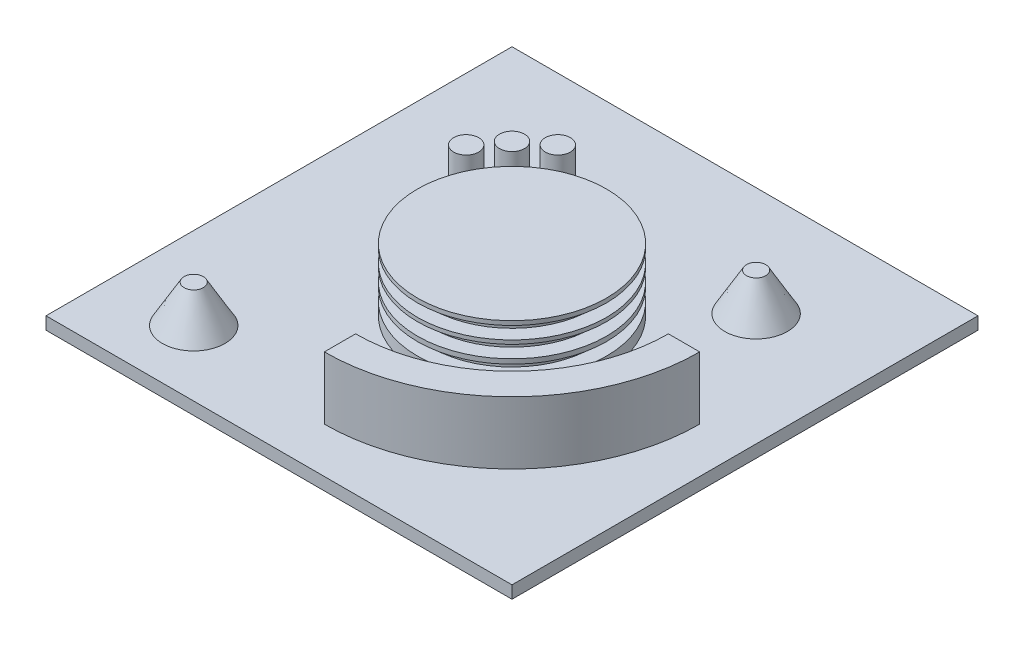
ISO-10303-21;
HEADER;
FILE_DESCRIPTION(('STEP AP214'),'2;1');
FILE_NAME('part.step','',(''),(''),'','','');
FILE_SCHEMA(('AUTOMOTIVE_DESIGN { 1 0 10303 214 1 1 1 1 }'));
ENDSEC;
DATA;
#1=APPLICATION_CONTEXT('core data for automotive mechanical design processes');
#2=APPLICATION_PROTOCOL_DEFINITION('international standard','automotive_design',2000,#1);
#3=PRODUCT_CONTEXT('',#1,'mechanical');
#4=PRODUCT('Part','Part','',(#3));
#5=PRODUCT_RELATED_PRODUCT_CATEGORY('part','',(#4));
#6=PRODUCT_DEFINITION_FORMATION('','',#4);
#7=PRODUCT_DEFINITION_CONTEXT('part definition',#1,'design');
#8=PRODUCT_DEFINITION('design','',#6,#7);
#9=PRODUCT_DEFINITION_SHAPE('','',#8);
#10=(LENGTH_UNIT() NAMED_UNIT(*) SI_UNIT(.MILLI.,.METRE.));
#11=(NAMED_UNIT(*) PLANE_ANGLE_UNIT() SI_UNIT($,.RADIAN.));
#12=(NAMED_UNIT(*) SI_UNIT($,.STERADIAN.) SOLID_ANGLE_UNIT());
#13=UNCERTAINTY_MEASURE_WITH_UNIT(LENGTH_MEASURE(1.E-05),#10,'distance_accuracy_value','');
#14=(GEOMETRIC_REPRESENTATION_CONTEXT(3) GLOBAL_UNCERTAINTY_ASSIGNED_CONTEXT((#13)) GLOBAL_UNIT_ASSIGNED_CONTEXT((#10,
#11,#12)) REPRESENTATION_CONTEXT('',''));
#15=CARTESIAN_POINT('',(0.,0.,0.));
#16=DIRECTION('',(0.,0.,1.));
#17=DIRECTION('',(1.,0.,0.));
#18=AXIS2_PLACEMENT_3D('',#15,#16,#17);
#19=CARTESIAN_POINT('',(0.,15.24,0.));
#20=DIRECTION('',(0.,-1.,0.));
#21=DIRECTION('',(0.,0.,-1.));
#22=AXIS2_PLACEMENT_3D('',#19,#20,#21);
#23=CYLINDRICAL_SURFACE('',#22,19.1850048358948);
#24=CARTESIAN_POINT('',(0.,8.54029885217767,0.));
#25=DIRECTION('',(0.,1.,0.));
#26=DIRECTION('',(0.,0.,1.));
#27=AXIS2_PLACEMENT_3D('',#24,#25,#26);
#28=CIRCLE('',#27,19.1850048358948);
#29=CARTESIAN_POINT('',(0.,8.54029885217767,19.1850048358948));
#30=VERTEX_POINT('',#29);
#31=EDGE_CURVE('E180',#30,#30,#28,.T.);
#32=ORIENTED_EDGE('',*,*,#31,.F.);
#33=EDGE_LOOP('',(#32));
#34=FACE_BOUND('',#33,.T.);
#35=CARTESIAN_POINT('',(0.,7.58720550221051,0.));
#36=DIRECTION('',(0.,-1.,0.));
#37=DIRECTION('',(0.,0.,-1.));
#38=AXIS2_PLACEMENT_3D('',#35,#36,#37);
#39=CIRCLE('',#38,19.1850048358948);
#40=CARTESIAN_POINT('',(0.,7.58720550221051,-19.1850048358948));
#41=VERTEX_POINT('',#40);
#42=EDGE_CURVE('E184',#41,#41,#39,.T.);
#43=ORIENTED_EDGE('',*,*,#42,.F.);
#44=EDGE_LOOP('',(#43));
#45=FACE_BOUND('',#44,.T.);
#46=ADVANCED_FACE('F32',(#34,#45),#23,.T.);
#47=CARTESIAN_POINT('',(0.,11.8521905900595,0.));
#48=DIRECTION('',(0.,1.,0.));
#49=DIRECTION('',(0.,0.,1.));
#50=AXIS2_PLACEMENT_3D('',#47,#48,#49);
#51=CIRCLE('',#50,19.1850048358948);
#52=CARTESIAN_POINT('',(0.,11.8521905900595,19.1850048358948));
#53=VERTEX_POINT('',#52);
#54=EDGE_CURVE('E172',#53,#53,#51,.T.);
#55=ORIENTED_EDGE('',*,*,#54,.F.);
#56=EDGE_LOOP('',(#55));
#57=FACE_BOUND('',#56,.T.);
#58=CARTESIAN_POINT('',(0.,11.0802988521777,0.));
#59=DIRECTION('',(0.,-1.,0.));
#60=DIRECTION('',(0.,0.,-1.));
#61=AXIS2_PLACEMENT_3D('',#58,#59,#60);
#62=CIRCLE('',#61,19.1850048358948);
#63=CARTESIAN_POINT('',(0.,11.0802988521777,-19.1850048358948));
#64=VERTEX_POINT('',#63);
#65=EDGE_CURVE('E177',#64,#64,#62,.T.);
#66=ORIENTED_EDGE('',*,*,#65,.F.);
#67=EDGE_LOOP('',(#66));
#68=FACE_BOUND('',#67,.T.);
#69=ADVANCED_FACE('F248',(#57,#68),#23,.T.);
#70=CARTESIAN_POINT('',(0.,11.8521905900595,-16.2967884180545));
#71=DIRECTION('',(0.,1.,0.));
#72=DIRECTION('',(0.,0.,1.));
#73=AXIS2_PLACEMENT_3D('',#70,#71,#72);
#74=PLANE('',#73);
#75=CARTESIAN_POINT('',(0.,11.8521905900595,0.));
#76=DIRECTION('',(0.,1.,0.));
#77=DIRECTION('',(0.,0.,1.));
#78=AXIS2_PLACEMENT_3D('',#75,#76,#77);
#79=CIRCLE('',#78,16.2967884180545);
#80=CARTESIAN_POINT('',(0.,11.8521905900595,16.2967884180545));
#81=VERTEX_POINT('',#80);
#82=EDGE_CURVE('E173',#81,#81,#79,.T.);
#83=ORIENTED_EDGE('',*,*,#82,.F.);
#84=EDGE_LOOP('',(#83));
#85=FACE_BOUND('',#84,.T.);
#86=ORIENTED_EDGE('',*,*,#54,.T.);
#87=EDGE_LOOP('',(#86));
#88=FACE_BOUND('',#87,.T.);
#89=ADVANCED_FACE('F255',(#85,#88),#74,.T.);
#90=CARTESIAN_POINT('',(0.,14.3921905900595,-16.2967884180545));
#91=DIRECTION('',(0.,-1.,0.));
#92=DIRECTION('',(0.,0.,-1.));
#93=AXIS2_PLACEMENT_3D('',#90,#91,#92);
#94=PLANE('',#93);
#95=CARTESIAN_POINT('',(0.,14.3921905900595,0.));
#96=DIRECTION('',(0.,1.,0.));
#97=DIRECTION('',(0.,0.,1.));
#98=AXIS2_PLACEMENT_3D('',#95,#96,#97);
#99=CIRCLE('',#98,16.2967884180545);
#100=CARTESIAN_POINT('',(0.,14.3921905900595,16.2967884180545));
#101=VERTEX_POINT('',#100);
#102=EDGE_CURVE('E183',#101,#101,#99,.T.);
#103=ORIENTED_EDGE('',*,*,#102,.T.);
#104=EDGE_LOOP('',(#103));
#105=FACE_BOUND('',#104,.T.);
#106=CARTESIAN_POINT('',(0.,14.3921905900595,0.));
#107=DIRECTION('',(0.,-1.,0.));
#108=DIRECTION('',(0.,0.,-1.));
#109=AXIS2_PLACEMENT_3D('',#106,#107,#108);
#110=CIRCLE('',#109,19.1850048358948);
#111=CARTESIAN_POINT('',(0.,14.3921905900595,-19.1850048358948));
#112=VERTEX_POINT('',#111);
#113=EDGE_CURVE('E169',#112,#112,#110,.T.);
#114=ORIENTED_EDGE('',*,*,#113,.T.);
#115=EDGE_LOOP('',(#114));
#116=FACE_BOUND('',#115,.T.);
#117=ADVANCED_FACE('F289',(#105,#116),#94,.T.);
#118=CARTESIAN_POINT('',(0.,15.24,0.));
#119=DIRECTION('',(0.,1.,0.));
#120=DIRECTION('',(0.,0.,1.));
#121=AXIS2_PLACEMENT_3D('',#118,#119,#120);
#122=CYLINDRICAL_SURFACE('',#121,16.2967884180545);
#123=ORIENTED_EDGE('',*,*,#82,.T.);
#124=EDGE_LOOP('',(#123));
#125=FACE_BOUND('',#124,.T.);
#126=ORIENTED_EDGE('',*,*,#102,.F.);
#127=EDGE_LOOP('',(#126));
#128=FACE_BOUND('',#127,.T.);
#129=ADVANCED_FACE('F283',(#125,#128),#122,.T.);
#130=CARTESIAN_POINT('',(0.,15.24,0.));
#131=DIRECTION('',(0.,1.,0.));
#132=DIRECTION('',(0.,0.,1.));
#133=AXIS2_PLACEMENT_3D('',#130,#131,#132);
#134=PLANE('',#133);
#135=CARTESIAN_POINT('',(0.,15.24,0.));
#136=DIRECTION('',(0.,1.,0.));
#137=DIRECTION('',(0.,0.,1.));
#138=AXIS2_PLACEMENT_3D('',#135,#136,#137);
#139=CIRCLE('',#138,19.1850048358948);
#140=CARTESIAN_POINT('',(0.,15.24,19.1850048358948));
#141=VERTEX_POINT('',#140);
#142=EDGE_CURVE('E221',#141,#141,#139,.T.);
#143=ORIENTED_EDGE('',*,*,#142,.T.);
#144=EDGE_LOOP('',(#143));
#145=FACE_BOUND('',#144,.T.);
#146=ADVANCED_FACE('F274',(#145),#134,.T.);
#147=ORIENTED_EDGE('',*,*,#142,.F.);
#148=EDGE_LOOP('',(#147));
#149=FACE_BOUND('',#148,.T.);
#150=ORIENTED_EDGE('',*,*,#113,.F.);
#151=EDGE_LOOP('',(#150));
#152=FACE_BOUND('',#151,.T.);
#153=ADVANCED_FACE('F257',(#149,#152),#23,.T.);
#154=CARTESIAN_POINT('',(0.,8.54029885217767,-16.2967884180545));
#155=DIRECTION('',(0.,1.,0.));
#156=DIRECTION('',(0.,0.,1.));
#157=AXIS2_PLACEMENT_3D('',#154,#155,#156);
#158=PLANE('',#157);
#159=CARTESIAN_POINT('',(0.,8.54029885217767,0.));
#160=DIRECTION('',(0.,1.,0.));
#161=DIRECTION('',(0.,0.,1.));
#162=AXIS2_PLACEMENT_3D('',#159,#160,#161);
#163=CIRCLE('',#162,16.2967884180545);
#164=CARTESIAN_POINT('',(0.,8.54029885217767,16.2967884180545));
#165=VERTEX_POINT('',#164);
#166=EDGE_CURVE('E181',#165,#165,#163,.T.);
#167=ORIENTED_EDGE('',*,*,#166,.F.);
#168=EDGE_LOOP('',(#167));
#169=FACE_BOUND('',#168,.T.);
#170=ORIENTED_EDGE('',*,*,#31,.T.);
#171=EDGE_LOOP('',(#170));
#172=FACE_BOUND('',#171,.T.);
#173=ADVANCED_FACE('F273',(#169,#172),#158,.T.);
#174=CARTESIAN_POINT('',(0.,11.0802988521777,-16.2967884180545));
#175=DIRECTION('',(0.,-1.,0.));
#176=DIRECTION('',(0.,0.,-1.));
#177=AXIS2_PLACEMENT_3D('',#174,#175,#176);
#178=PLANE('',#177);
#179=CARTESIAN_POINT('',(0.,11.0802988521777,0.));
#180=DIRECTION('',(0.,1.,0.));
#181=DIRECTION('',(0.,0.,1.));
#182=AXIS2_PLACEMENT_3D('',#179,#180,#181);
#183=CIRCLE('',#182,16.2967884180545);
#184=CARTESIAN_POINT('',(0.,11.0802988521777,16.2967884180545));
#185=VERTEX_POINT('',#184);
#186=EDGE_CURVE('E190',#185,#185,#183,.T.);
#187=ORIENTED_EDGE('',*,*,#186,.T.);
#188=EDGE_LOOP('',(#187));
#189=FACE_BOUND('',#188,.T.);
#190=ORIENTED_EDGE('',*,*,#65,.T.);
#191=EDGE_LOOP('',(#190));
#192=FACE_BOUND('',#191,.T.);
#193=ADVANCED_FACE('F280',(#189,#192),#178,.T.);
#194=CARTESIAN_POINT('',(0.,15.24,0.));
#195=DIRECTION('',(0.,1.,0.));
#196=DIRECTION('',(0.,0.,1.));
#197=AXIS2_PLACEMENT_3D('',#194,#195,#196);
#198=CYLINDRICAL_SURFACE('',#197,16.2967884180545);
#199=ORIENTED_EDGE('',*,*,#166,.T.);
#200=EDGE_LOOP('',(#199));
#201=FACE_BOUND('',#200,.T.);
#202=ORIENTED_EDGE('',*,*,#186,.F.);
#203=EDGE_LOOP('',(#202));
#204=FACE_BOUND('',#203,.T.);
#205=ADVANCED_FACE('F302',(#201,#204),#198,.T.);
#206=CARTESIAN_POINT('',(0.,5.04720550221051,-16.2967884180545));
#207=DIRECTION('',(0.,1.,0.));
#208=DIRECTION('',(0.,0.,1.));
#209=AXIS2_PLACEMENT_3D('',#206,#207,#208);
#210=PLANE('',#209);
#211=CARTESIAN_POINT('',(0.,5.04720550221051,0.));
#212=DIRECTION('',(0.,1.,0.));
#213=DIRECTION('',(0.,0.,1.));
#214=AXIS2_PLACEMENT_3D('',#211,#212,#213);
#215=CIRCLE('',#214,16.2967884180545);
#216=CARTESIAN_POINT('',(0.,5.04720550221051,16.2967884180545));
#217=VERTEX_POINT('',#216);
#218=EDGE_CURVE('E186',#217,#217,#215,.T.);
#219=ORIENTED_EDGE('',*,*,#218,.F.);
#220=EDGE_LOOP('',(#219));
#221=FACE_BOUND('',#220,.T.);
#222=CARTESIAN_POINT('',(0.,5.04720550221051,0.));
#223=DIRECTION('',(0.,1.,0.));
#224=DIRECTION('',(0.,0.,1.));
#225=AXIS2_PLACEMENT_3D('',#222,#223,#224);
#226=CIRCLE('',#225,19.1850048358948);
#227=CARTESIAN_POINT('',(0.,5.04720550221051,19.1850048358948));
#228=VERTEX_POINT('',#227);
#229=EDGE_CURVE('E36',#228,#228,#226,.T.);
#230=ORIENTED_EDGE('',*,*,#229,.T.);
#231=EDGE_LOOP('',(#230));
#232=FACE_BOUND('',#231,.T.);
#233=ADVANCED_FACE('F430',(#221,#232),#210,.T.);
#234=CARTESIAN_POINT('',(0.,7.58720550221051,-16.2967884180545));
#235=DIRECTION('',(0.,-1.,0.));
#236=DIRECTION('',(0.,0.,-1.));
#237=AXIS2_PLACEMENT_3D('',#234,#235,#236);
#238=PLANE('',#237);
#239=CARTESIAN_POINT('',(0.,7.58720550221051,0.));
#240=DIRECTION('',(0.,1.,0.));
#241=DIRECTION('',(0.,0.,1.));
#242=AXIS2_PLACEMENT_3D('',#239,#240,#241);
#243=CIRCLE('',#242,16.2967884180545);
#244=CARTESIAN_POINT('',(0.,7.58720550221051,16.2967884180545));
#245=VERTEX_POINT('',#244);
#246=EDGE_CURVE('E192',#245,#245,#243,.T.);
#247=ORIENTED_EDGE('',*,*,#246,.T.);
#248=EDGE_LOOP('',(#247));
#249=FACE_BOUND('',#248,.T.);
#250=ORIENTED_EDGE('',*,*,#42,.T.);
#251=EDGE_LOOP('',(#250));
#252=FACE_BOUND('',#251,.T.);
#253=ADVANCED_FACE('F439',(#249,#252),#238,.T.);
#254=CARTESIAN_POINT('',(0.,15.24,0.));
#255=DIRECTION('',(0.,1.,0.));
#256=DIRECTION('',(0.,0.,1.));
#257=AXIS2_PLACEMENT_3D('',#254,#255,#256);
#258=CYLINDRICAL_SURFACE('',#257,16.2967884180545);
#259=ORIENTED_EDGE('',*,*,#218,.T.);
#260=EDGE_LOOP('',(#259));
#261=FACE_BOUND('',#260,.T.);
#262=ORIENTED_EDGE('',*,*,#246,.F.);
#263=EDGE_LOOP('',(#262));
#264=FACE_BOUND('',#263,.T.);
#265=ADVANCED_FACE('F308',(#261,#264),#258,.T.);
#266=CARTESIAN_POINT('',(-30.6027669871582,10.16,34.0079217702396));
#267=DIRECTION('',(0.,1.,0.));
#268=DIRECTION('',(0.,0.,1.));
#269=AXIS2_PLACEMENT_3D('',#266,#267,#268);
#270=PLANE('',#269);
#271=CARTESIAN_POINT('',(-30.6027669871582,10.16,34.0079217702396));
#272=DIRECTION('',(0.,1.,0.));
#273=DIRECTION('',(0.,0.,1.));
#274=AXIS2_PLACEMENT_3D('',#271,#272,#273);
#275=CIRCLE('',#274,1.95059094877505);
#276=CARTESIAN_POINT('',(-30.6027669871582,10.16,35.9585127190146));
#277=VERTEX_POINT('',#276);
#278=EDGE_CURVE('E176',#277,#277,#275,.T.);
#279=ORIENTED_EDGE('',*,*,#278,.T.);
#280=EDGE_LOOP('',(#279));
#281=FACE_BOUND('',#280,.T.);
#282=ADVANCED_FACE('F304',(#281),#270,.T.);
#283=CARTESIAN_POINT('',(-21.9970452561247,15.24,-12.7));
#284=DIRECTION('',(0.,1.,0.));
#285=DIRECTION('',(0.,0.,1.));
#286=AXIS2_PLACEMENT_3D('',#283,#284,#285);
#287=PLANE('',#286);
#288=CARTESIAN_POINT('',(-21.9970452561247,15.24,-12.7));
#289=DIRECTION('',(0.,1.,0.));
#290=DIRECTION('',(0.,0.,1.));
#291=AXIS2_PLACEMENT_3D('',#288,#289,#290);
#292=CIRCLE('',#291,2.54);
#293=CARTESIAN_POINT('',(-21.9970452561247,15.24,-10.16));
#294=VERTEX_POINT('',#293);
#295=EDGE_CURVE('E212',#294,#294,#292,.T.);
#296=ORIENTED_EDGE('',*,*,#295,.T.);
#297=EDGE_LOOP('',(#296));
#298=FACE_BOUND('',#297,.T.);
#299=ADVANCED_FACE('F307',(#298),#287,.T.);
#300=CARTESIAN_POINT('',(-12.6999999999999,15.24,-21.9970452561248));
#301=DIRECTION('',(0.,1.,0.));
#302=DIRECTION('',(0.,0.,1.));
#303=AXIS2_PLACEMENT_3D('',#300,#301,#302);
#304=PLANE('',#303);
#305=CARTESIAN_POINT('',(-12.6999999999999,15.24,-21.9970452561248));
#306=DIRECTION('',(0.,1.,0.));
#307=DIRECTION('',(0.,0.,1.));
#308=AXIS2_PLACEMENT_3D('',#305,#306,#307);
#309=CIRCLE('',#308,2.54);
#310=CARTESIAN_POINT('',(-12.6999999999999,15.24,-19.4570452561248));
#311=VERTEX_POINT('',#310);
#312=EDGE_CURVE('E218',#311,#311,#309,.T.);
#313=ORIENTED_EDGE('',*,*,#312,.T.);
#314=EDGE_LOOP('',(#313));
#315=FACE_BOUND('',#314,.T.);
#316=ADVANCED_FACE('F326',(#315),#304,.T.);
#317=CARTESIAN_POINT('',(0.,15.24,0.));
#318=DIRECTION('',(0.,1.,0.));
#319=DIRECTION('',(0.,0.,1.));
#320=AXIS2_PLACEMENT_3D('',#317,#318,#319);
#321=PLANE('',#320);
#322=CARTESIAN_POINT('',(0.,15.24,0.));
#323=DIRECTION('',(0.,1.,0.));
#324=DIRECTION('',(0.,0.,1.));
#325=AXIS2_PLACEMENT_3D('',#322,#323,#324);
#326=CIRCLE('',#325,38.1);
#327=CARTESIAN_POINT('',(0.,15.24,38.1));
#328=VERTEX_POINT('',#327);
#329=CARTESIAN_POINT('',(38.1,15.24,0.));
#330=VERTEX_POINT('',#329);
#331=EDGE_CURVE('E107',#328,#330,#326,.T.);
#332=ORIENTED_EDGE('',*,*,#331,.T.);
#333=DIRECTION('',(-1.,0.,0.));
#334=VECTOR('',#333,1.);
#335=CARTESIAN_POINT('',(31.75,15.24,0.));
#336=LINE('',#335,#334);
#337=CARTESIAN_POINT('',(31.75,15.24,0.));
#338=VERTEX_POINT('',#337);
#339=EDGE_CURVE('E96',#330,#338,#336,.T.);
#340=ORIENTED_EDGE('',*,*,#339,.T.);
#341=CARTESIAN_POINT('',(0.,15.24,0.));
#342=DIRECTION('',(0.,-1.,0.));
#343=DIRECTION('',(0.,0.,-1.));
#344=AXIS2_PLACEMENT_3D('',#341,#342,#343);
#345=CIRCLE('',#344,31.75);
#346=CARTESIAN_POINT('',(0.,15.24,31.75));
#347=VERTEX_POINT('',#346);
#348=EDGE_CURVE('E106',#338,#347,#345,.T.);
#349=ORIENTED_EDGE('',*,*,#348,.T.);
#350=DIRECTION('',(0.,0.,1.));
#351=VECTOR('',#350,1.);
#352=CARTESIAN_POINT('',(0.,15.24,31.75));
#353=LINE('',#352,#351);
#354=EDGE_CURVE('E112',#347,#328,#353,.T.);
#355=ORIENTED_EDGE('',*,*,#354,.T.);
#356=EDGE_LOOP('',(#332,#340,#349,#355));
#357=FACE_BOUND('',#356,.T.);
#358=ADVANCED_FACE('F110',(#357),#321,.T.);
#359=CARTESIAN_POINT('',(-47.2962725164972,0.,-47.2962725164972));
#360=DIRECTION('',(0.,-1.,0.));
#361=DIRECTION('',(0.,0.,-1.));
#362=AXIS2_PLACEMENT_3D('',#359,#360,#361);
#363=PLANE('',#362);
#364=DIRECTION('',(0.,0.,1.));
#365=VECTOR('',#364,1.);
#366=CARTESIAN_POINT('',(-47.2962725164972,0.,47.2962725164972));
#367=LINE('',#366,#365);
#368=CARTESIAN_POINT('',(-47.2962725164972,0.,-47.2962725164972));
#369=VERTEX_POINT('',#368);
#370=CARTESIAN_POINT('',(-47.2962725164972,0.,47.2962725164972));
#371=VERTEX_POINT('',#370);
#372=EDGE_CURVE('E120',#369,#371,#367,.T.);
#373=ORIENTED_EDGE('',*,*,#372,.F.);
#374=DIRECTION('',(-1.,0.,0.));
#375=VECTOR('',#374,1.);
#376=CARTESIAN_POINT('',(-47.2962725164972,0.,-47.2962725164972));
#377=LINE('',#376,#375);
#378=CARTESIAN_POINT('',(47.2962725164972,0.,-47.2962725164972));
#379=VERTEX_POINT('',#378);
#380=EDGE_CURVE('E132',#379,#369,#377,.T.);
#381=ORIENTED_EDGE('',*,*,#380,.F.);
#382=DIRECTION('',(0.,0.,-1.));
#383=VECTOR('',#382,1.);
#384=CARTESIAN_POINT('',(47.2962725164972,0.,47.2962725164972));
#385=LINE('',#384,#383);
#386=CARTESIAN_POINT('',(47.2962725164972,0.,47.2962725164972));
#387=VERTEX_POINT('',#386);
#388=EDGE_CURVE('E130',#387,#379,#385,.T.);
#389=ORIENTED_EDGE('',*,*,#388,.F.);
#390=DIRECTION('',(1.,0.,0.));
#391=VECTOR('',#390,1.);
#392=CARTESIAN_POINT('',(-47.2962725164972,0.,47.2962725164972));
#393=LINE('',#392,#391);
#394=EDGE_CURVE('E123',#371,#387,#393,.T.);
#395=ORIENTED_EDGE('',*,*,#394,.F.);
#396=EDGE_LOOP('',(#373,#381,#389,#395));
#397=FACE_BOUND('',#396,.T.);
#398=ADVANCED_FACE('F333',(#397),#363,.T.);
#399=CARTESIAN_POINT('',(-17.9605122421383,15.24,-17.9605122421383));
#400=DIRECTION('',(0.,1.,0.));
#401=DIRECTION('',(0.,0.,1.));
#402=AXIS2_PLACEMENT_3D('',#399,#400,#401);
#403=PLANE('',#402);
#404=CARTESIAN_POINT('',(-17.9605122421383,15.24,-17.9605122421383));
#405=DIRECTION('',(0.,1.,0.));
#406=DIRECTION('',(0.,0.,1.));
#407=AXIS2_PLACEMENT_3D('',#404,#405,#406);
#408=CIRCLE('',#407,2.54);
#409=CARTESIAN_POINT('',(-17.9605122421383,15.24,-15.4205122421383));
#410=VERTEX_POINT('',#409);
#411=EDGE_CURVE('E215',#410,#410,#408,.T.);
#412=ORIENTED_EDGE('',*,*,#411,.T.);
#413=EDGE_LOOP('',(#412));
#414=FACE_BOUND('',#413,.T.);
#415=ADVANCED_FACE('F318',(#414),#403,.T.);
#416=CARTESIAN_POINT('',(24.3768164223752,10.16,-25.1816606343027));
#417=DIRECTION('',(0.,1.,0.));
#418=DIRECTION('',(0.,0.,1.));
#419=AXIS2_PLACEMENT_3D('',#416,#417,#418);
#420=PLANE('',#419);
#421=CARTESIAN_POINT('',(24.3768164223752,10.16,-25.1816606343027));
#422=DIRECTION('',(0.,1.,0.));
#423=DIRECTION('',(0.,0.,1.));
#424=AXIS2_PLACEMENT_3D('',#421,#422,#423);
#425=CIRCLE('',#424,1.95059094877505);
#426=CARTESIAN_POINT('',(24.3768164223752,10.16,-23.2310696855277));
#427=VERTEX_POINT('',#426);
#428=EDGE_CURVE('E209',#427,#427,#425,.T.);
#429=ORIENTED_EDGE('',*,*,#428,.T.);
#430=EDGE_LOOP('',(#429));
#431=FACE_BOUND('',#430,.T.);
#432=ADVANCED_FACE('F314',(#431),#420,.T.);
#433=CARTESIAN_POINT('',(-30.6027669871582,2.54,34.0079217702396));
#434=DIRECTION('',(0.,-1.,0.));
#435=DIRECTION('',(0.,0.,1.));
#436=AXIS2_PLACEMENT_3D('',#433,#434,#435);
#437=CONICAL_SURFACE('',#436,6.35,0.523598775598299);
#438=CARTESIAN_POINT('',(-30.6027669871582,2.54,34.0079217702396));
#439=DIRECTION('',(0.,-1.,0.));
#440=DIRECTION('',(0.,0.,-1.));
#441=AXIS2_PLACEMENT_3D('',#438,#439,#440);
#442=CIRCLE('',#441,6.35);
#443=CARTESIAN_POINT('',(-30.6027669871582,2.54,40.3579217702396));
#444=VERTEX_POINT('',#443);
#445=EDGE_CURVE('E11',#444,#444,#442,.F.);
#446=CARTESIAN_POINT('',(-30.6027669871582,10.16,35.9585127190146));
#447=CARTESIAN_POINT('',(-30.6027669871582,10.080625,36.0043398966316));
#448=CARTESIAN_POINT('',(-30.6027669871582,10.00125,36.0501670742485));
#449=CARTESIAN_POINT('',(-30.6027669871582,9.8425,36.1418214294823));
#450=CARTESIAN_POINT('',(-30.6027669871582,9.763125,36.1876486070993));
#451=CARTESIAN_POINT('',(-30.6027669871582,9.604375,36.2793029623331));
#452=CARTESIAN_POINT('',(-30.6027669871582,9.525,36.3251301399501));
#453=CARTESIAN_POINT('',(-30.6027669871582,9.36625,36.4167844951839));
#454=CARTESIAN_POINT('',(-30.6027669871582,9.286875,36.4626116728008));
#455=CARTESIAN_POINT('',(-30.6027669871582,9.128125,36.5542660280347));
#456=CARTESIAN_POINT('',(-30.6027669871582,9.04875,36.6000932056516));
#457=CARTESIAN_POINT('',(-30.6027669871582,8.89,36.6917475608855));
#458=CARTESIAN_POINT('',(-30.6027669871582,8.810625,36.7375747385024));
#459=CARTESIAN_POINT('',(-30.6027669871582,8.651875,36.8292290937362));
#460=CARTESIAN_POINT('',(-30.6027669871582,8.5725,36.8750562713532));
#461=CARTESIAN_POINT('',(-30.6027669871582,8.41375,36.966710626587));
#462=CARTESIAN_POINT('',(-30.6027669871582,8.334375,37.012537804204));
#463=CARTESIAN_POINT('',(-30.6027669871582,8.175625,37.1041921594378));
#464=CARTESIAN_POINT('',(-30.6027669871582,8.09625,37.1500193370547));
#465=CARTESIAN_POINT('',(-30.6027669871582,7.9375,37.2416736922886));
#466=CARTESIAN_POINT('',(-30.6027669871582,7.858125,37.2875008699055));
#467=CARTESIAN_POINT('',(-30.6027669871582,7.699375,37.3791552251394));
#468=CARTESIAN_POINT('',(-30.6027669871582,7.62,37.4249824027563));
#469=CARTESIAN_POINT('',(-30.6027669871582,7.46125,37.5166367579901));
#470=CARTESIAN_POINT('',(-30.6027669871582,7.381875,37.5624639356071));
#471=CARTESIAN_POINT('',(-30.6027669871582,7.223125,37.6541182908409));
#472=CARTESIAN_POINT('',(-30.6027669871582,7.14375,37.6999454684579));
#473=CARTESIAN_POINT('',(-30.6027669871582,6.985,37.7915998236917));
#474=CARTESIAN_POINT('',(-30.6027669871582,6.905625,37.8374270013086));
#475=CARTESIAN_POINT('',(-30.6027669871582,6.746875,37.9290813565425));
#476=CARTESIAN_POINT('',(-30.6027669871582,6.6675,37.9749085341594));
#477=CARTESIAN_POINT('',(-30.6027669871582,6.50875,38.0665628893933));
#478=CARTESIAN_POINT('',(-30.6027669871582,6.429375,38.1123900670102));
#479=CARTESIAN_POINT('',(-30.6027669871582,6.270625,38.204044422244));
#480=CARTESIAN_POINT('',(-30.6027669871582,6.19125,38.249871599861));
#481=CARTESIAN_POINT('',(-30.6027669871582,6.0325,38.3415259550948));
#482=CARTESIAN_POINT('',(-30.6027669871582,5.953125,38.3873531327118));
#483=CARTESIAN_POINT('',(-30.6027669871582,5.794375,38.4790074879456));
#484=CARTESIAN_POINT('',(-30.6027669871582,5.715,38.5248346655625));
#485=CARTESIAN_POINT('',(-30.6027669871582,5.55625,38.6164890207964));
#486=CARTESIAN_POINT('',(-30.6027669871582,5.476875,38.6623161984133));
#487=CARTESIAN_POINT('',(-30.6027669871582,5.318125,38.7539705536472));
#488=CARTESIAN_POINT('',(-30.6027669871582,5.23875,38.7997977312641));
#489=CARTESIAN_POINT('',(-30.6027669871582,5.08,38.8914520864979));
#490=CARTESIAN_POINT('',(-30.6027669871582,5.000625,38.9372792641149));
#491=CARTESIAN_POINT('',(-30.6027669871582,4.841875,39.0289336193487));
#492=CARTESIAN_POINT('',(-30.6027669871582,4.7625,39.0747607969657));
#493=CARTESIAN_POINT('',(-30.6027669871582,4.60375,39.1664151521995));
#494=CARTESIAN_POINT('',(-30.6027669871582,4.524375,39.2122423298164));
#495=CARTESIAN_POINT('',(-30.6027669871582,4.365625,39.3038966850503));
#496=CARTESIAN_POINT('',(-30.6027669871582,4.28625,39.3497238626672));
#497=CARTESIAN_POINT('',(-30.6027669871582,4.1275,39.4413782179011));
#498=CARTESIAN_POINT('',(-30.6027669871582,4.048125,39.487205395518));
#499=CARTESIAN_POINT('',(-30.6027669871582,3.889375,39.5788597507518));
#500=CARTESIAN_POINT('',(-30.6027669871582,3.81,39.6246869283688));
#501=CARTESIAN_POINT('',(-30.6027669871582,3.65125,39.7163412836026));
#502=CARTESIAN_POINT('',(-30.6027669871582,3.571875,39.7621684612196));
#503=CARTESIAN_POINT('',(-30.6027669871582,3.413125,39.8538228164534));
#504=CARTESIAN_POINT('',(-30.6027669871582,3.33375,39.8996499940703));
#505=CARTESIAN_POINT('',(-30.6027669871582,3.175,39.9913043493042));
#506=CARTESIAN_POINT('',(-30.6027669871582,3.095625,40.0371315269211));
#507=CARTESIAN_POINT('',(-30.6027669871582,2.936875,40.128785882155));
#508=CARTESIAN_POINT('',(-30.6027669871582,2.8575,40.1746130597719));
#509=CARTESIAN_POINT('',(-30.6027669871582,2.69875,40.2662674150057));
#510=CARTESIAN_POINT('',(-30.6027669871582,2.619375,40.3120945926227));
#511=CARTESIAN_POINT('',(-30.6027669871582,2.54,40.3579217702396));
#512=B_SPLINE_CURVE_WITH_KNOTS('',3,(#446,#447,#448,#449,#450,#451,#452,#453,#454,#455,#456,
#457,#458,#459,#460,#461,#462,#463,#464,#465,#466,#467,#468,#469,#470,#471,#472,#473,#474,#475,
#476,#477,#478,#479,#480,#481,#482,#483,#484,#485,#486,#487,#488,#489,#490,#491,#492,#493,#494,
#495,#496,#497,#498,#499,#500,#501,#502,#503,#504,#505,#506,#507,#508,#509,#510,#511),
.UNSPECIFIED.,.F.,.F.,(4,2,2,2,2,2,2,2,2,2,2,2,2,2,2,2,2,2,2,2,2,2,2,2,2,2,2,2,2,2,2,2,4),(0.,
0.274963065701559,0.549926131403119,0.824889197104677,1.09985226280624,1.3748153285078,
1.64977839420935,1.92474145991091,2.19970452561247,2.47466759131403,2.74963065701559,
3.02459372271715,3.29955678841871,3.57451985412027,3.84948291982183,4.12444598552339,
4.39940905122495,4.67437211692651,4.94933518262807,5.22429824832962,5.49926131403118,
5.77422437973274,6.0491874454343,6.32415051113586,6.59911357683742,6.87407664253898,
7.14903970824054,7.4240027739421,7.69896583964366,7.97392890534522,8.24889197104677,
8.52385503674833,8.79881810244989),.UNSPECIFIED.);
#513=EDGE_CURVE('BSEAM310',#277,#444,#512,.T.);
#514=ORIENTED_EDGE('',*,*,#278,.F.);
#515=ORIENTED_EDGE('',*,*,#445,.T.);
#516=ORIENTED_EDGE('',*,*,#513,.T.);
#517=ORIENTED_EDGE('',*,*,#513,.F.);
#518=EDGE_LOOP('',(#514,#516,#515,#517));
#519=FACE_BOUND('',#518,.T.);
#520=ADVANCED_FACE('F310',(#519),#437,.T.);
#521=CARTESIAN_POINT('',(-21.9970452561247,15.24,-12.7));
#522=DIRECTION('',(0.,-1.,0.));
#523=DIRECTION('',(0.,0.,-1.));
#524=AXIS2_PLACEMENT_3D('',#521,#522,#523);
#525=CYLINDRICAL_SURFACE('',#524,2.54);
#526=ORIENTED_EDGE('',*,*,#295,.F.);
#527=EDGE_LOOP('',(#526));
#528=FACE_BOUND('',#527,.T.);
#529=CARTESIAN_POINT('',(-21.9970452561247,2.54,-12.7));
#530=DIRECTION('',(0.,-1.,0.));
#531=DIRECTION('',(0.,0.,-1.));
#532=AXIS2_PLACEMENT_3D('',#529,#530,#531);
#533=CIRCLE('',#532,2.54);
#534=CARTESIAN_POINT('',(-21.9970452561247,2.54,-15.24));
#535=VERTEX_POINT('',#534);
#536=EDGE_CURVE('E164',#535,#535,#533,.F.);
#537=ORIENTED_EDGE('',*,*,#536,.T.);
#538=EDGE_LOOP('',(#537));
#539=FACE_BOUND('',#538,.T.);
#540=ADVANCED_FACE('F313',(#528,#539),#525,.T.);
#541=CARTESIAN_POINT('',(-12.6999999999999,15.24,-21.9970452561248));
#542=DIRECTION('',(0.,-1.,0.));
#543=DIRECTION('',(0.,0.,-1.));
#544=AXIS2_PLACEMENT_3D('',#541,#542,#543);
#545=CYLINDRICAL_SURFACE('',#544,2.54);
#546=ORIENTED_EDGE('',*,*,#312,.F.);
#547=EDGE_LOOP('',(#546));
#548=FACE_BOUND('',#547,.T.);
#549=CARTESIAN_POINT('',(-12.6999999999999,2.54,-21.9970452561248));
#550=DIRECTION('',(0.,-1.,0.));
#551=DIRECTION('',(0.,0.,-1.));
#552=AXIS2_PLACEMENT_3D('',#549,#550,#551);
#553=CIRCLE('',#552,2.54);
#554=CARTESIAN_POINT('',(-12.6999999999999,2.54,-24.5370452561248));
#555=VERTEX_POINT('',#554);
#556=EDGE_CURVE('E158',#555,#555,#553,.F.);
#557=ORIENTED_EDGE('',*,*,#556,.T.);
#558=EDGE_LOOP('',(#557));
#559=FACE_BOUND('',#558,.T.);
#560=ADVANCED_FACE('F245',(#548,#559),#545,.T.);
#561=CARTESIAN_POINT('',(31.75,15.24,0.));
#562=DIRECTION('',(0.,0.,1.));
#563=DIRECTION('',(1.,0.,0.));
#564=AXIS2_PLACEMENT_3D('',#561,#562,#563);
#565=PLANE('',#564);
#566=DIRECTION('',(-1.,0.,0.));
#567=VECTOR('',#566,1.);
#568=CARTESIAN_POINT('',(31.75,2.54,0.));
#569=LINE('',#568,#567);
#570=CARTESIAN_POINT('',(38.1,2.54,0.));
#571=VERTEX_POINT('',#570);
#572=CARTESIAN_POINT('',(31.75,2.54,0.));
#573=VERTEX_POINT('',#572);
#574=EDGE_CURVE('E49',#571,#573,#569,.T.);
#575=ORIENTED_EDGE('',*,*,#574,.T.);
#576=DIRECTION('',(0.,-1.,0.));
#577=VECTOR('',#576,1.);
#578=CARTESIAN_POINT('',(31.75,15.24,0.));
#579=LINE('',#578,#577);
#580=EDGE_CURVE('E103',#338,#573,#579,.T.);
#581=ORIENTED_EDGE('',*,*,#580,.F.);
#582=ORIENTED_EDGE('',*,*,#339,.F.);
#583=DIRECTION('',(0.,-1.,0.));
#584=VECTOR('',#583,1.);
#585=CARTESIAN_POINT('',(38.1,15.24,0.));
#586=LINE('',#585,#584);
#587=EDGE_CURVE('E100',#330,#571,#586,.T.);
#588=ORIENTED_EDGE('',*,*,#587,.T.);
#589=EDGE_LOOP('',(#575,#581,#582,#588));
#590=FACE_BOUND('',#589,.T.);
#591=ADVANCED_FACE('F98',(#590),#565,.F.);
#592=CARTESIAN_POINT('',(0.,15.24,0.));
#593=DIRECTION('',(0.,-1.,0.));
#594=DIRECTION('',(0.,0.,-1.));
#595=AXIS2_PLACEMENT_3D('',#592,#593,#594);
#596=CYLINDRICAL_SURFACE('',#595,31.75);
#597=CARTESIAN_POINT('',(0.,2.54,0.));
#598=DIRECTION('',(0.,-1.,0.));
#599=DIRECTION('',(0.,0.,-1.));
#600=AXIS2_PLACEMENT_3D('',#597,#598,#599);
#601=CIRCLE('',#600,31.75);
#602=CARTESIAN_POINT('',(0.,2.54,31.75));
#603=VERTEX_POINT('',#602);
#604=EDGE_CURVE('E54',#573,#603,#601,.T.);
#605=ORIENTED_EDGE('',*,*,#604,.T.);
#606=DIRECTION('',(0.,-1.,0.));
#607=VECTOR('',#606,1.);
#608=CARTESIAN_POINT('',(0.,15.24,31.75));
#609=LINE('',#608,#607);
#610=EDGE_CURVE('E125',#347,#603,#609,.T.);
#611=ORIENTED_EDGE('',*,*,#610,.F.);
#612=ORIENTED_EDGE('',*,*,#348,.F.);
#613=ORIENTED_EDGE('',*,*,#580,.T.);
#614=EDGE_LOOP('',(#605,#611,#612,#613));
#615=FACE_BOUND('',#614,.T.);
#616=ADVANCED_FACE('F237',(#615),#596,.F.);
#617=CARTESIAN_POINT('',(0.,15.24,31.75));
#618=DIRECTION('',(1.,0.,0.));
#619=DIRECTION('',(0.,0.,-1.));
#620=AXIS2_PLACEMENT_3D('',#617,#618,#619);
#621=PLANE('',#620);
#622=DIRECTION('',(0.,0.,1.));
#623=VECTOR('',#622,1.);
#624=CARTESIAN_POINT('',(0.,2.54,31.75));
#625=LINE('',#624,#623);
#626=CARTESIAN_POINT('',(0.,2.54,38.1));
#627=VERTEX_POINT('',#626);
#628=EDGE_CURVE('E116',#603,#627,#625,.T.);
#629=ORIENTED_EDGE('',*,*,#628,.T.);
#630=DIRECTION('',(0.,-1.,0.));
#631=VECTOR('',#630,1.);
#632=CARTESIAN_POINT('',(0.,15.24,38.1));
#633=LINE('',#632,#631);
#634=EDGE_CURVE('E226',#328,#627,#633,.T.);
#635=ORIENTED_EDGE('',*,*,#634,.F.);
#636=ORIENTED_EDGE('',*,*,#354,.F.);
#637=ORIENTED_EDGE('',*,*,#610,.T.);
#638=EDGE_LOOP('',(#629,#635,#636,#637));
#639=FACE_BOUND('',#638,.T.);
#640=ADVANCED_FACE('F235',(#639),#621,.F.);
#641=CARTESIAN_POINT('',(0.,15.24,0.));
#642=DIRECTION('',(0.,-1.,0.));
#643=DIRECTION('',(0.,0.,-1.));
#644=AXIS2_PLACEMENT_3D('',#641,#642,#643);
#645=CYLINDRICAL_SURFACE('',#644,38.1);
#646=CARTESIAN_POINT('',(0.,2.54,0.));
#647=DIRECTION('',(0.,1.,0.));
#648=DIRECTION('',(0.,0.,1.));
#649=AXIS2_PLACEMENT_3D('',#646,#647,#648);
#650=CIRCLE('',#649,38.1);
#651=EDGE_CURVE('E119',#627,#571,#650,.T.);
#652=ORIENTED_EDGE('',*,*,#651,.T.);
#653=ORIENTED_EDGE('',*,*,#587,.F.);
#654=ORIENTED_EDGE('',*,*,#331,.F.);
#655=ORIENTED_EDGE('',*,*,#634,.T.);
#656=EDGE_LOOP('',(#652,#653,#654,#655));
#657=FACE_BOUND('',#656,.T.);
#658=ADVANCED_FACE('F118',(#657),#645,.T.);
#659=CARTESIAN_POINT('',(-47.2962725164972,2.54,-47.2962725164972));
#660=DIRECTION('',(0.,0.,1.));
#661=DIRECTION('',(1.,0.,0.));
#662=AXIS2_PLACEMENT_3D('',#659,#660,#661);
#663=PLANE('',#662);
#664=ORIENTED_EDGE('',*,*,#380,.T.);
#665=DIRECTION('',(0.,-1.,0.));
#666=VECTOR('',#665,1.);
#667=CARTESIAN_POINT('',(-47.2962725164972,2.54,-47.2962725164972));
#668=LINE('',#667,#666);
#669=CARTESIAN_POINT('',(-47.2962725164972,2.54,-47.2962725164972));
#670=VERTEX_POINT('',#669);
#671=EDGE_CURVE('E143',#670,#369,#668,.T.);
#672=ORIENTED_EDGE('',*,*,#671,.F.);
#673=DIRECTION('',(-1.,0.,0.));
#674=VECTOR('',#673,1.);
#675=CARTESIAN_POINT('',(-47.2962725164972,2.54,-47.2962725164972));
#676=LINE('',#675,#674);
#677=CARTESIAN_POINT('',(47.2962725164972,2.54,-47.2962725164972));
#678=VERTEX_POINT('',#677);
#679=EDGE_CURVE('E141',#678,#670,#676,.T.);
#680=ORIENTED_EDGE('',*,*,#679,.F.);
#681=DIRECTION('',(0.,-1.,0.));
#682=VECTOR('',#681,1.);
#683=CARTESIAN_POINT('',(47.2962725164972,2.54,-47.2962725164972));
#684=LINE('',#683,#682);
#685=EDGE_CURVE('E146',#678,#379,#684,.T.);
#686=ORIENTED_EDGE('',*,*,#685,.T.);
#687=EDGE_LOOP('',(#664,#672,#680,#686));
#688=FACE_BOUND('',#687,.T.);
#689=ADVANCED_FACE('F557',(#688),#663,.F.);
#690=CARTESIAN_POINT('',(47.2962725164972,2.54,47.2962725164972));
#691=DIRECTION('',(-1.,0.,0.));
#692=DIRECTION('',(0.,0.,1.));
#693=AXIS2_PLACEMENT_3D('',#690,#691,#692);
#694=PLANE('',#693);
#695=ORIENTED_EDGE('',*,*,#388,.T.);
#696=ORIENTED_EDGE('',*,*,#685,.F.);
#697=DIRECTION('',(0.,0.,-1.));
#698=VECTOR('',#697,1.);
#699=CARTESIAN_POINT('',(47.2962725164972,2.54,47.2962725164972));
#700=LINE('',#699,#698);
#701=CARTESIAN_POINT('',(47.2962725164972,2.54,47.2962725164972));
#702=VERTEX_POINT('',#701);
#703=EDGE_CURVE('E139',#702,#678,#700,.T.);
#704=ORIENTED_EDGE('',*,*,#703,.F.);
#705=DIRECTION('',(0.,-1.,0.));
#706=VECTOR('',#705,1.);
#707=CARTESIAN_POINT('',(47.2962725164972,2.54,47.2962725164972));
#708=LINE('',#707,#706);
#709=EDGE_CURVE('E149',#702,#387,#708,.T.);
#710=ORIENTED_EDGE('',*,*,#709,.T.);
#711=EDGE_LOOP('',(#695,#696,#704,#710));
#712=FACE_BOUND('',#711,.T.);
#713=ADVANCED_FACE('F550',(#712),#694,.F.);
#714=CARTESIAN_POINT('',(-47.2962725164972,2.54,47.2962725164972));
#715=DIRECTION('',(0.,0.,-1.));
#716=DIRECTION('',(-1.,0.,0.));
#717=AXIS2_PLACEMENT_3D('',#714,#715,#716);
#718=PLANE('',#717);
#719=ORIENTED_EDGE('',*,*,#394,.T.);
#720=ORIENTED_EDGE('',*,*,#709,.F.);
#721=DIRECTION('',(1.,0.,0.));
#722=VECTOR('',#721,1.);
#723=CARTESIAN_POINT('',(-47.2962725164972,2.54,47.2962725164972));
#724=LINE('',#723,#722);
#725=CARTESIAN_POINT('',(-47.2962725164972,2.54,47.2962725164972));
#726=VERTEX_POINT('',#725);
#727=EDGE_CURVE('E137',#726,#702,#724,.T.);
#728=ORIENTED_EDGE('',*,*,#727,.F.);
#729=DIRECTION('',(0.,-1.,0.));
#730=VECTOR('',#729,1.);
#731=CARTESIAN_POINT('',(-47.2962725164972,2.54,47.2962725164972));
#732=LINE('',#731,#730);
#733=EDGE_CURVE('E152',#726,#371,#732,.T.);
#734=ORIENTED_EDGE('',*,*,#733,.T.);
#735=EDGE_LOOP('',(#719,#720,#728,#734));
#736=FACE_BOUND('',#735,.T.);
#737=ADVANCED_FACE('F543',(#736),#718,.F.);
#738=CARTESIAN_POINT('',(-47.2962725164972,2.54,47.2962725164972));
#739=DIRECTION('',(1.,0.,0.));
#740=DIRECTION('',(0.,0.,-1.));
#741=AXIS2_PLACEMENT_3D('',#738,#739,#740);
#742=PLANE('',#741);
#743=ORIENTED_EDGE('',*,*,#372,.T.);
#744=ORIENTED_EDGE('',*,*,#733,.F.);
#745=DIRECTION('',(0.,0.,1.));
#746=VECTOR('',#745,1.);
#747=CARTESIAN_POINT('',(-47.2962725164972,2.54,47.2962725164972));
#748=LINE('',#747,#746);
#749=EDGE_CURVE('E134',#670,#726,#748,.T.);
#750=ORIENTED_EDGE('',*,*,#749,.F.);
#751=ORIENTED_EDGE('',*,*,#671,.T.);
#752=EDGE_LOOP('',(#743,#744,#750,#751));
#753=FACE_BOUND('',#752,.T.);
#754=ADVANCED_FACE('F34',(#753),#742,.F.);
#755=CARTESIAN_POINT('',(-17.9605122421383,15.24,-17.9605122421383));
#756=DIRECTION('',(0.,-1.,0.));
#757=DIRECTION('',(0.,0.,-1.));
#758=AXIS2_PLACEMENT_3D('',#755,#756,#757);
#759=CYLINDRICAL_SURFACE('',#758,2.54);
#760=ORIENTED_EDGE('',*,*,#411,.F.);
#761=EDGE_LOOP('',(#760));
#762=FACE_BOUND('',#761,.T.);
#763=CARTESIAN_POINT('',(-17.9605122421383,2.54,-17.9605122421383));
#764=DIRECTION('',(0.,-1.,0.));
#765=DIRECTION('',(0.,0.,-1.));
#766=AXIS2_PLACEMENT_3D('',#763,#764,#765);
#767=CIRCLE('',#766,2.54);
#768=CARTESIAN_POINT('',(-17.9605122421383,2.54,-20.5005122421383));
#769=VERTEX_POINT('',#768);
#770=EDGE_CURVE('E161',#769,#769,#767,.F.);
#771=ORIENTED_EDGE('',*,*,#770,.T.);
#772=EDGE_LOOP('',(#771));
#773=FACE_BOUND('',#772,.T.);
#774=ADVANCED_FACE('F322',(#762,#773),#759,.T.);
#775=CARTESIAN_POINT('',(24.3768164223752,2.54,-25.1816606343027));
#776=DIRECTION('',(0.,-1.,0.));
#777=DIRECTION('',(0.,0.,1.));
#778=AXIS2_PLACEMENT_3D('',#775,#776,#777);
#779=CONICAL_SURFACE('',#778,6.35,0.523598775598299);
#780=CARTESIAN_POINT('',(24.3768164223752,2.54,-25.1816606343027));
#781=DIRECTION('',(0.,-1.,0.));
#782=DIRECTION('',(0.,0.,-1.));
#783=AXIS2_PLACEMENT_3D('',#780,#781,#782);
#784=CIRCLE('',#783,6.35);
#785=CARTESIAN_POINT('',(24.3768164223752,2.54,-18.8316606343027));
#786=VERTEX_POINT('',#785);
#787=EDGE_CURVE('E41',#786,#786,#784,.F.);
#788=CARTESIAN_POINT('',(24.3768164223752,10.16,-23.2310696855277));
#789=CARTESIAN_POINT('',(24.3768164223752,10.080625,-23.1852425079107));
#790=CARTESIAN_POINT('',(24.3768164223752,10.00125,-23.1394153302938));
#791=CARTESIAN_POINT('',(24.3768164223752,9.8425,-23.04776097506));
#792=CARTESIAN_POINT('',(24.3768164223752,9.763125,-23.001933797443));
#793=CARTESIAN_POINT('',(24.3768164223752,9.604375,-22.9102794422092));
#794=CARTESIAN_POINT('',(24.3768164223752,9.525,-22.8644522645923));
#795=CARTESIAN_POINT('',(24.3768164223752,9.36625,-22.7727979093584));
#796=CARTESIAN_POINT('',(24.3768164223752,9.286875,-22.7269707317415));
#797=CARTESIAN_POINT('',(24.3768164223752,9.128125,-22.6353163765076));
#798=CARTESIAN_POINT('',(24.3768164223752,9.04875,-22.5894891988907));
#799=CARTESIAN_POINT('',(24.3768164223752,8.89,-22.4978348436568));
#800=CARTESIAN_POINT('',(24.3768164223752,8.810625,-22.4520076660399));
#801=CARTESIAN_POINT('',(24.3768164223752,8.651875,-22.3603533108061));
#802=CARTESIAN_POINT('',(24.3768164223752,8.5725,-22.3145261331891));
#803=CARTESIAN_POINT('',(24.3768164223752,8.41375,-22.2228717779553));
#804=CARTESIAN_POINT('',(24.3768164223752,8.334375,-22.1770446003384));
#805=CARTESIAN_POINT('',(24.3768164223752,8.175625,-22.0853902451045));
#806=CARTESIAN_POINT('',(24.3768164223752,8.09625,-22.0395630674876));
#807=CARTESIAN_POINT('',(24.3768164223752,7.9375,-21.9479087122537));
#808=CARTESIAN_POINT('',(24.3768164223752,7.858125,-21.9020815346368));
#809=CARTESIAN_POINT('',(24.3768164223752,7.699375,-21.8104271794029));
#810=CARTESIAN_POINT('',(24.3768164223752,7.62,-21.764600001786));
#811=CARTESIAN_POINT('',(24.3768164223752,7.46125,-21.6729456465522));
#812=CARTESIAN_POINT('',(24.3768164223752,7.381875,-21.6271184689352));
#813=CARTESIAN_POINT('',(24.3768164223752,7.223125,-21.5354641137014));
#814=CARTESIAN_POINT('',(24.3768164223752,7.14375,-21.4896369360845));
#815=CARTESIAN_POINT('',(24.3768164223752,6.985,-21.3979825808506));
#816=CARTESIAN_POINT('',(24.3768164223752,6.905625,-21.3521554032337));
#817=CARTESIAN_POINT('',(24.3768164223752,6.746875,-21.2605010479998));
#818=CARTESIAN_POINT('',(24.3768164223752,6.6675,-21.2146738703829));
#819=CARTESIAN_POINT('',(24.3768164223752,6.50875,-21.123019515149));
#820=CARTESIAN_POINT('',(24.3768164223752,6.429375,-21.0771923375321));
#821=CARTESIAN_POINT('',(24.3768164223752,6.270625,-20.9855379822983));
#822=CARTESIAN_POINT('',(24.3768164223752,6.19125,-20.9397108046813));
#823=CARTESIAN_POINT('',(24.3768164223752,6.0325,-20.8480564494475));
#824=CARTESIAN_POINT('',(24.3768164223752,5.953125,-20.8022292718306));
#825=CARTESIAN_POINT('',(24.3768164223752,5.794375,-20.7105749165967));
#826=CARTESIAN_POINT('',(24.3768164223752,5.715,-20.6647477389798));
#827=CARTESIAN_POINT('',(24.3768164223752,5.55625,-20.5730933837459));
#828=CARTESIAN_POINT('',(24.3768164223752,5.476875,-20.527266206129));
#829=CARTESIAN_POINT('',(24.3768164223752,5.318125,-20.4356118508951));
#830=CARTESIAN_POINT('',(24.3768164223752,5.23875,-20.3897846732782));
#831=CARTESIAN_POINT('',(24.3768164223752,5.08,-20.2981303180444));
#832=CARTESIAN_POINT('',(24.3768164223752,5.000625,-20.2523031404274));
#833=CARTESIAN_POINT('',(24.3768164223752,4.841875,-20.1606487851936));
#834=CARTESIAN_POINT('',(24.3768164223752,4.7625,-20.1148216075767));
#835=CARTESIAN_POINT('',(24.3768164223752,4.60375,-20.0231672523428));
#836=CARTESIAN_POINT('',(24.3768164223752,4.524375,-19.9773400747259));
#837=CARTESIAN_POINT('',(24.3768164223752,4.365625,-19.885685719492));
#838=CARTESIAN_POINT('',(24.3768164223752,4.28625,-19.8398585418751));
#839=CARTESIAN_POINT('',(24.3768164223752,4.1275,-19.7482041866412));
#840=CARTESIAN_POINT('',(24.3768164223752,4.048125,-19.7023770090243));
#841=CARTESIAN_POINT('',(24.3768164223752,3.889375,-19.6107226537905));
#842=CARTESIAN_POINT('',(24.3768164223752,3.81,-19.5648954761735));
#843=CARTESIAN_POINT('',(24.3768164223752,3.65125,-19.4732411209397));
#844=CARTESIAN_POINT('',(24.3768164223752,3.571875,-19.4274139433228));
#845=CARTESIAN_POINT('',(24.3768164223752,3.413125,-19.3357595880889));
#846=CARTESIAN_POINT('',(24.3768164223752,3.33375,-19.289932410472));
#847=CARTESIAN_POINT('',(24.3768164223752,3.175,-19.1982780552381));
#848=CARTESIAN_POINT('',(24.3768164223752,3.095625,-19.1524508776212));
#849=CARTESIAN_POINT('',(24.3768164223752,2.936875,-19.0607965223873));
#850=CARTESIAN_POINT('',(24.3768164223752,2.8575,-19.0149693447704));
#851=CARTESIAN_POINT('',(24.3768164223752,2.69875,-18.9233149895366));
#852=CARTESIAN_POINT('',(24.3768164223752,2.619375,-18.8774878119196));
#853=CARTESIAN_POINT('',(24.3768164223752,2.54,-18.8316606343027));
#854=B_SPLINE_CURVE_WITH_KNOTS('',3,(#788,#789,#790,#791,#792,#793,#794,#795,#796,#797,#798,
#799,#800,#801,#802,#803,#804,#805,#806,#807,#808,#809,#810,#811,#812,#813,#814,#815,#816,#817,
#818,#819,#820,#821,#822,#823,#824,#825,#826,#827,#828,#829,#830,#831,#832,#833,#834,#835,#836,
#837,#838,#839,#840,#841,#842,#843,#844,#845,#846,#847,#848,#849,#850,#851,#852,#853),
.UNSPECIFIED.,.F.,.F.,(4,2,2,2,2,2,2,2,2,2,2,2,2,2,2,2,2,2,2,2,2,2,2,2,2,2,2,2,2,2,2,2,4),(0.,
0.274963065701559,0.549926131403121,0.824889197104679,1.09985226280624,1.3748153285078,
1.64977839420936,1.92474145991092,2.19970452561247,2.47466759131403,2.74963065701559,
3.02459372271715,3.29955678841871,3.57451985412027,3.84948291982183,4.12444598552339,
4.39940905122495,4.67437211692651,4.94933518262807,5.22429824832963,5.49926131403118,
5.77422437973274,6.0491874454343,6.32415051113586,6.59911357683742,6.87407664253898,
7.14903970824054,7.4240027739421,7.69896583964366,7.97392890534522,8.24889197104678,
8.52385503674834,8.79881810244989),.UNSPECIFIED.);
#855=EDGE_CURVE('BSEAM268',#427,#786,#854,.T.);
#856=ORIENTED_EDGE('',*,*,#428,.F.);
#857=ORIENTED_EDGE('',*,*,#787,.T.);
#858=ORIENTED_EDGE('',*,*,#855,.T.);
#859=ORIENTED_EDGE('',*,*,#855,.F.);
#860=EDGE_LOOP('',(#856,#858,#857,#859));
#861=FACE_BOUND('',#860,.T.);
#862=ADVANCED_FACE('F268',(#861),#779,.T.);
#863=CARTESIAN_POINT('',(-47.2962725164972,2.54,-47.2962725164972));
#864=DIRECTION('',(0.,-1.,0.));
#865=DIRECTION('',(0.,0.,-1.));
#866=AXIS2_PLACEMENT_3D('',#863,#864,#865);
#867=PLANE('',#866);
#868=ORIENTED_EDGE('',*,*,#787,.F.);
#869=EDGE_LOOP('',(#868));
#870=FACE_BOUND('',#869,.T.);
#871=ORIENTED_EDGE('',*,*,#770,.F.);
#872=EDGE_LOOP('',(#871));
#873=FACE_BOUND('',#872,.T.);
#874=CARTESIAN_POINT('',(0.,2.54,0.));
#875=DIRECTION('',(0.,-1.,0.));
#876=DIRECTION('',(0.,0.,-1.));
#877=AXIS2_PLACEMENT_3D('',#874,#875,#876);
#878=CIRCLE('',#877,19.1850048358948);
#879=CARTESIAN_POINT('',(0.,2.54,-19.1850048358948));
#880=VERTEX_POINT('',#879);
#881=EDGE_CURVE('E155',#880,#880,#878,.F.);
#882=ORIENTED_EDGE('',*,*,#881,.F.);
#883=EDGE_LOOP('',(#882));
#884=FACE_BOUND('',#883,.T.);
#885=ORIENTED_EDGE('',*,*,#749,.T.);
#886=ORIENTED_EDGE('',*,*,#727,.T.);
#887=ORIENTED_EDGE('',*,*,#703,.T.);
#888=ORIENTED_EDGE('',*,*,#679,.T.);
#889=EDGE_LOOP('',(#885,#886,#887,#888));
#890=FACE_BOUND('',#889,.T.);
#891=ORIENTED_EDGE('',*,*,#651,.F.);
#892=ORIENTED_EDGE('',*,*,#628,.F.);
#893=ORIENTED_EDGE('',*,*,#604,.F.);
#894=ORIENTED_EDGE('',*,*,#574,.F.);
#895=EDGE_LOOP('',(#891,#892,#893,#894));
#896=FACE_BOUND('',#895,.T.);
#897=ORIENTED_EDGE('',*,*,#556,.F.);
#898=EDGE_LOOP('',(#897));
#899=FACE_BOUND('',#898,.T.);
#900=ORIENTED_EDGE('',*,*,#536,.F.);
#901=EDGE_LOOP('',(#900));
#902=FACE_BOUND('',#901,.T.);
#903=ORIENTED_EDGE('',*,*,#445,.F.);
#904=EDGE_LOOP('',(#903));
#905=FACE_BOUND('',#904,.T.);
#906=ADVANCED_FACE('F263',(#870,#873,#884,#890,#896,#899,#902,#905),#867,.F.);
#907=ORIENTED_EDGE('',*,*,#881,.T.);
#908=EDGE_LOOP('',(#907));
#909=FACE_BOUND('',#908,.T.);
#910=ORIENTED_EDGE('',*,*,#229,.F.);
#911=EDGE_LOOP('',(#910));
#912=FACE_BOUND('',#911,.T.);
#913=ADVANCED_FACE('F251',(#909,#912),#23,.T.);
#914=CLOSED_SHELL('',(#46,#69,#89,#117,#129,#146,#153,#173,#193,#205,#233,#253,#265,#282,#299,
#316,#358,#398,#415,#432,#520,#540,#560,#591,#616,#640,#658,#689,#713,#737,#754,#774,#862,#906,#913));
#915=MANIFOLD_SOLID_BREP('B2',#914);
#916=ADVANCED_BREP_SHAPE_REPRESENTATION('',(#18,#915),#14);
#917=SHAPE_DEFINITION_REPRESENTATION(#9,#916);
ENDSEC;
END-ISO-10303-21;
